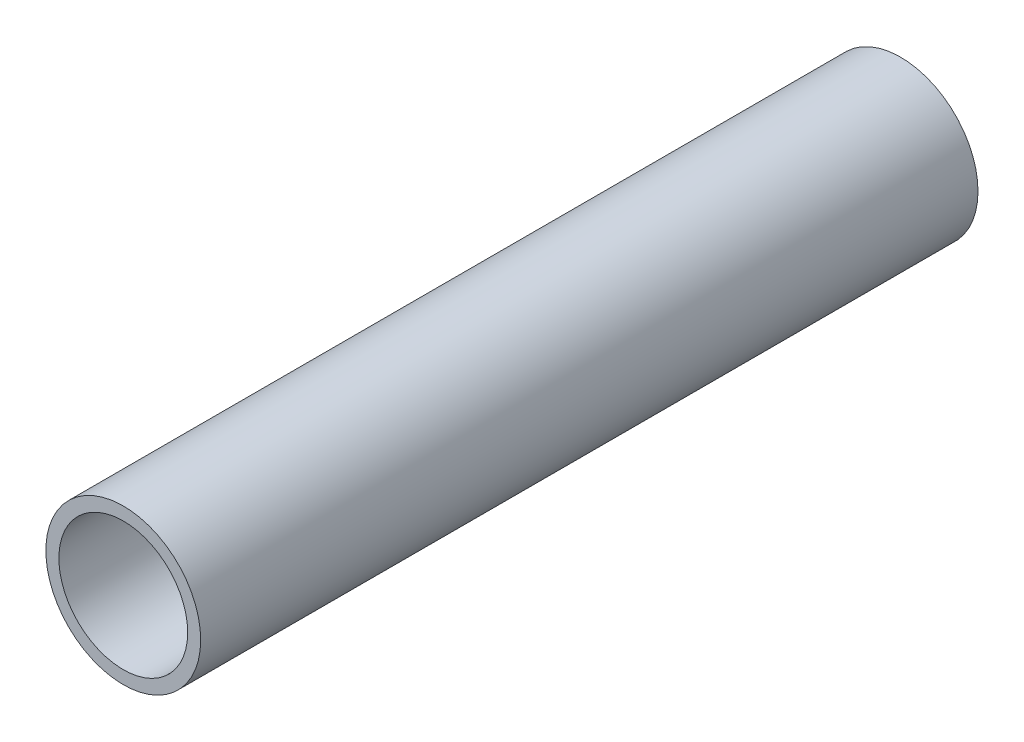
ISO-10303-21;
HEADER;
FILE_DESCRIPTION(('STEP AP214'),'2;1');
FILE_NAME('part.step','',(''),(''),'','','');
FILE_SCHEMA(('AUTOMOTIVE_DESIGN { 1 0 10303 214 1 1 1 1 }'));
ENDSEC;
DATA;
#1=APPLICATION_CONTEXT('core data for automotive mechanical design processes');
#2=APPLICATION_PROTOCOL_DEFINITION('international standard','automotive_design',2000,#1);
#3=PRODUCT_CONTEXT('',#1,'mechanical');
#4=PRODUCT('Part','Part','',(#3));
#5=PRODUCT_RELATED_PRODUCT_CATEGORY('part','',(#4));
#6=PRODUCT_DEFINITION_FORMATION('','',#4);
#7=PRODUCT_DEFINITION_CONTEXT('part definition',#1,'design');
#8=PRODUCT_DEFINITION('design','',#6,#7);
#9=PRODUCT_DEFINITION_SHAPE('','',#8);
#10=(LENGTH_UNIT() NAMED_UNIT(*) SI_UNIT(.MILLI.,.METRE.));
#11=(NAMED_UNIT(*) PLANE_ANGLE_UNIT() SI_UNIT($,.RADIAN.));
#12=(NAMED_UNIT(*) SI_UNIT($,.STERADIAN.) SOLID_ANGLE_UNIT());
#13=UNCERTAINTY_MEASURE_WITH_UNIT(LENGTH_MEASURE(1.E-05),#10,'distance_accuracy_value','');
#14=(GEOMETRIC_REPRESENTATION_CONTEXT(3) GLOBAL_UNCERTAINTY_ASSIGNED_CONTEXT((#13)) GLOBAL_UNIT_ASSIGNED_CONTEXT((#10,
#11,#12)) REPRESENTATION_CONTEXT('',''));
#15=CARTESIAN_POINT('',(0.,0.,0.));
#16=DIRECTION('',(0.,0.,1.));
#17=DIRECTION('',(1.,0.,0.));
#18=AXIS2_PLACEMENT_3D('',#15,#16,#17);
#19=CARTESIAN_POINT('',(0.,0.,29.87));
#20=DIRECTION('',(0.,0.,-1.));
#21=DIRECTION('',(-1.,0.,0.));
#22=AXIS2_PLACEMENT_3D('',#19,#20,#21);
#23=CYLINDRICAL_SURFACE('',#22,2.975);
#24=CARTESIAN_POINT('',(0.,0.,29.87));
#25=DIRECTION('',(0.,0.,1.));
#26=DIRECTION('',(1.,0.,0.));
#27=AXIS2_PLACEMENT_3D('',#24,#25,#26);
#28=CIRCLE('',#27,2.975);
#29=CARTESIAN_POINT('',(2.975,0.,29.87));
#30=VERTEX_POINT('',#29);
#31=EDGE_CURVE('E10',#30,#30,#28,.T.);
#32=ORIENTED_EDGE('',*,*,#31,.F.);
#33=EDGE_LOOP('',(#32));
#34=FACE_BOUND('',#33,.T.);
#35=CARTESIAN_POINT('',(0.,0.,0.));
#36=DIRECTION('',(0.,0.,1.));
#37=DIRECTION('',(1.,0.,0.));
#38=AXIS2_PLACEMENT_3D('',#35,#36,#37);
#39=CIRCLE('',#38,2.975);
#40=CARTESIAN_POINT('',(2.975,0.,0.));
#41=VERTEX_POINT('',#40);
#42=EDGE_CURVE('E32',#41,#41,#39,.T.);
#43=ORIENTED_EDGE('',*,*,#42,.T.);
#44=EDGE_LOOP('',(#43));
#45=FACE_BOUND('',#44,.T.);
#46=ADVANCED_FACE('F29',(#34,#45),#23,.T.);
#47=CARTESIAN_POINT('',(0.,0.,29.87));
#48=DIRECTION('',(0.,0.,1.));
#49=DIRECTION('',(1.,0.,0.));
#50=AXIS2_PLACEMENT_3D('',#47,#48,#49);
#51=PLANE('',#50);
#52=CARTESIAN_POINT('',(0.,0.,29.87));
#53=DIRECTION('',(0.,0.,1.));
#54=DIRECTION('',(1.,0.,0.));
#55=AXIS2_PLACEMENT_3D('',#52,#53,#54);
#56=CIRCLE('',#55,2.475);
#57=CARTESIAN_POINT('',(2.475,0.,29.87));
#58=VERTEX_POINT('',#57);
#59=EDGE_CURVE('E41',#58,#58,#56,.T.);
#60=ORIENTED_EDGE('',*,*,#59,.F.);
#61=EDGE_LOOP('',(#60));
#62=FACE_BOUND('',#61,.T.);
#63=ORIENTED_EDGE('',*,*,#31,.T.);
#64=EDGE_LOOP('',(#63));
#65=FACE_BOUND('',#64,.T.);
#66=ADVANCED_FACE('F56',(#62,#65),#51,.T.);
#67=CARTESIAN_POINT('',(0.,0.,0.));
#68=DIRECTION('',(0.,0.,1.));
#69=DIRECTION('',(1.,0.,0.));
#70=AXIS2_PLACEMENT_3D('',#67,#68,#69);
#71=PLANE('',#70);
#72=CARTESIAN_POINT('',(0.,0.,0.));
#73=DIRECTION('',(0.,0.,1.));
#74=DIRECTION('',(1.,0.,0.));
#75=AXIS2_PLACEMENT_3D('',#72,#73,#74);
#76=CIRCLE('',#75,2.475);
#77=CARTESIAN_POINT('',(2.475,0.,0.));
#78=VERTEX_POINT('',#77);
#79=EDGE_CURVE('E39',#78,#78,#76,.T.);
#80=ORIENTED_EDGE('',*,*,#79,.T.);
#81=EDGE_LOOP('',(#80));
#82=FACE_BOUND('',#81,.T.);
#83=ORIENTED_EDGE('',*,*,#42,.F.);
#84=EDGE_LOOP('',(#83));
#85=FACE_BOUND('',#84,.T.);
#86=ADVANCED_FACE('F47',(#82,#85),#71,.F.);
#87=CARTESIAN_POINT('',(0.,0.,0.));
#88=DIRECTION('',(0.,0.,1.));
#89=DIRECTION('',(1.,0.,0.));
#90=AXIS2_PLACEMENT_3D('',#87,#88,#89);
#91=CYLINDRICAL_SURFACE('',#90,2.475);
#92=ORIENTED_EDGE('',*,*,#79,.F.);
#93=EDGE_LOOP('',(#92));
#94=FACE_BOUND('',#93,.T.);
#95=ORIENTED_EDGE('',*,*,#59,.T.);
#96=EDGE_LOOP('',(#95));
#97=FACE_BOUND('',#96,.T.);
#98=ADVANCED_FACE('F50',(#94,#97),#91,.F.);
#99=CLOSED_SHELL('',(#46,#66,#86,#98));
#100=MANIFOLD_SOLID_BREP('B2',#99);
#101=ADVANCED_BREP_SHAPE_REPRESENTATION('',(#18,#100),#14);
#102=SHAPE_DEFINITION_REPRESENTATION(#9,#101);
ENDSEC;
END-ISO-10303-21;
